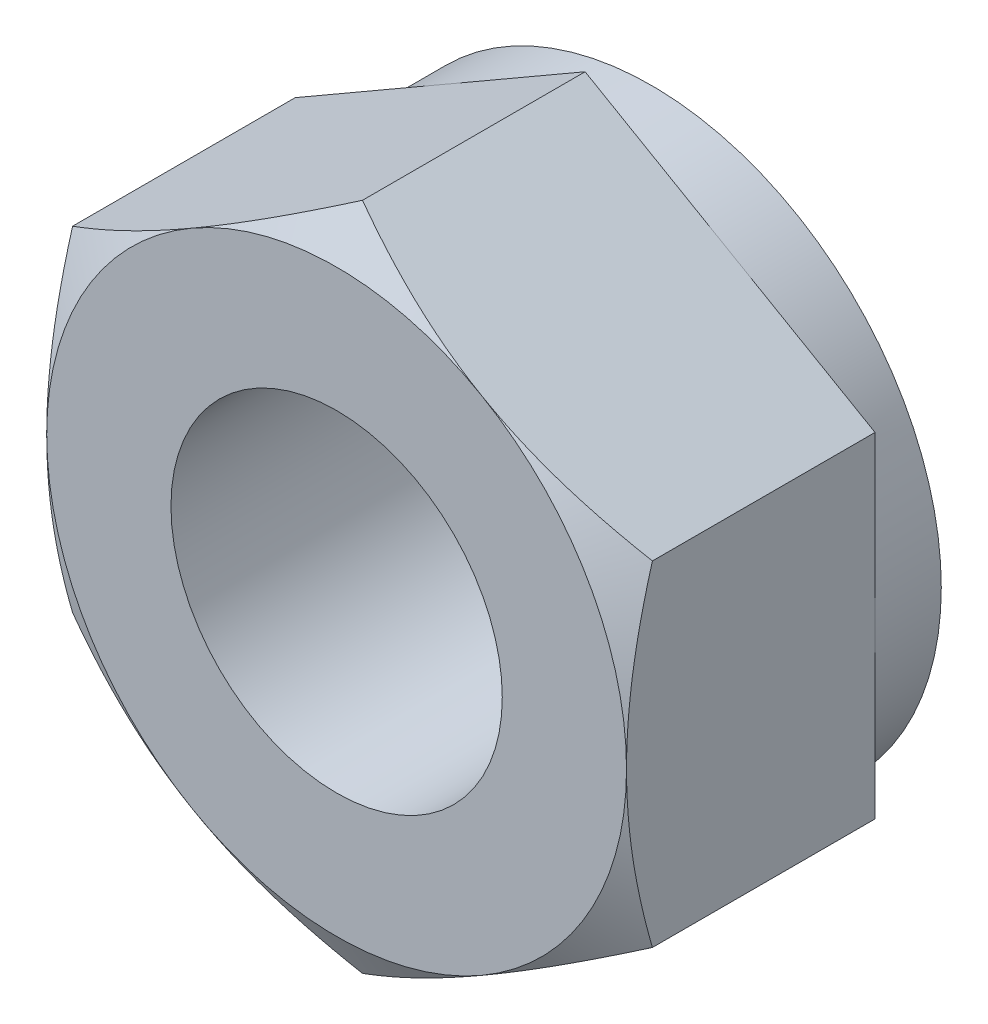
ISO-10303-21;
HEADER;
FILE_DESCRIPTION(('STEP AP214'),'2;1');
FILE_NAME('part.step','',(''),(''),'','','');
FILE_SCHEMA(('AUTOMOTIVE_DESIGN { 1 0 10303 214 1 1 1 1 }'));
ENDSEC;
DATA;
#1=APPLICATION_CONTEXT('core data for automotive mechanical design processes');
#2=APPLICATION_PROTOCOL_DEFINITION('international standard','automotive_design',2000,#1);
#3=PRODUCT_CONTEXT('',#1,'mechanical');
#4=PRODUCT('Part','Part','',(#3));
#5=PRODUCT_RELATED_PRODUCT_CATEGORY('part','',(#4));
#6=PRODUCT_DEFINITION_FORMATION('','',#4);
#7=PRODUCT_DEFINITION_CONTEXT('part definition',#1,'design');
#8=PRODUCT_DEFINITION('design','',#6,#7);
#9=PRODUCT_DEFINITION_SHAPE('','',#8);
#10=(LENGTH_UNIT() NAMED_UNIT(*) SI_UNIT(.MILLI.,.METRE.));
#11=(NAMED_UNIT(*) PLANE_ANGLE_UNIT() SI_UNIT($,.RADIAN.));
#12=(NAMED_UNIT(*) SI_UNIT($,.STERADIAN.) SOLID_ANGLE_UNIT());
#13=UNCERTAINTY_MEASURE_WITH_UNIT(LENGTH_MEASURE(1.E-05),#10,'distance_accuracy_value','');
#14=(GEOMETRIC_REPRESENTATION_CONTEXT(3) GLOBAL_UNCERTAINTY_ASSIGNED_CONTEXT((#13)) GLOBAL_UNIT_ASSIGNED_CONTEXT((#10,
#11,#12)) REPRESENTATION_CONTEXT('',''));
#15=CARTESIAN_POINT('',(0.,0.,0.));
#16=DIRECTION('',(0.,0.,1.));
#17=DIRECTION('',(1.,0.,0.));
#18=AXIS2_PLACEMENT_3D('',#15,#16,#17);
#19=CARTESIAN_POINT('',(0.,-4.,1.6));
#20=DIRECTION('',(0.,0.,-1.));
#21=DIRECTION('',(1.,0.,0.));
#22=AXIS2_PLACEMENT_3D('',#19,#20,#21);
#23=PLANE('',#22);
#24=DIRECTION('',(0.,-1.,0.));
#25=VECTOR('',#24,1.);
#26=CARTESIAN_POINT('',(7.,-4.04145188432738,1.6));
#27=LINE('',#26,#25);
#28=CARTESIAN_POINT('',(7.,4.0414518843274,1.6));
#29=VERTEX_POINT('',#28);
#30=CARTESIAN_POINT('',(7.,0.,1.6));
#31=VERTEX_POINT('',#30);
#32=EDGE_CURVE('E119',#29,#31,#27,.T.);
#33=ORIENTED_EDGE('',*,*,#32,.T.);
#34=CARTESIAN_POINT('',(0.,0.,1.6));
#35=DIRECTION('',(0.,0.,1.));
#36=DIRECTION('',(1.,0.,0.));
#37=AXIS2_PLACEMENT_3D('',#34,#35,#36);
#38=CIRCLE('',#37,7.);
#39=CARTESIAN_POINT('',(3.5,6.06217782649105,1.6));
#40=VERTEX_POINT('',#39);
#41=EDGE_CURVE('E32',#31,#40,#38,.T.);
#42=ORIENTED_EDGE('',*,*,#41,.T.);
#43=DIRECTION('',(0.866025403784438,-0.5,0.));
#44=VECTOR('',#43,1.);
#45=CARTESIAN_POINT('',(7.,4.0414518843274,1.6));
#46=LINE('',#45,#44);
#47=EDGE_CURVE('E117',#40,#29,#46,.T.);
#48=ORIENTED_EDGE('',*,*,#47,.T.);
#49=EDGE_LOOP('',(#33,#42,#48));
#50=FACE_BOUND('',#49,.T.);
#51=ADVANCED_FACE('F14',(#50),#23,.T.);
#52=CARTESIAN_POINT('',(0.,8.08290376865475,1.6));
#53=VERTEX_POINT('',#52);
#54=EDGE_CURVE('E128',#53,#40,#46,.T.);
#55=ORIENTED_EDGE('',*,*,#54,.T.);
#56=CARTESIAN_POINT('',(-3.5,6.0621778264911,1.6));
#57=VERTEX_POINT('',#56);
#58=EDGE_CURVE('E24',#40,#57,#38,.T.);
#59=ORIENTED_EDGE('',*,*,#58,.T.);
#60=DIRECTION('',(0.866025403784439,0.5,0.));
#61=VECTOR('',#60,1.);
#62=CARTESIAN_POINT('',(0.,8.08290376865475,1.6));
#63=LINE('',#62,#61);
#64=EDGE_CURVE('E134',#57,#53,#63,.T.);
#65=ORIENTED_EDGE('',*,*,#64,.T.);
#66=EDGE_LOOP('',(#55,#59,#65));
#67=FACE_BOUND('',#66,.T.);
#68=ADVANCED_FACE('F133',(#67),#23,.T.);
#69=CARTESIAN_POINT('',(-7.,4.0414518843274,1.6));
#70=VERTEX_POINT('',#69);
#71=EDGE_CURVE('E19',#70,#57,#63,.T.);
#72=ORIENTED_EDGE('',*,*,#71,.T.);
#73=CARTESIAN_POINT('',(-7.,0.,1.6));
#74=VERTEX_POINT('',#73);
#75=EDGE_CURVE('E109',#57,#74,#38,.T.);
#76=ORIENTED_EDGE('',*,*,#75,.T.);
#77=DIRECTION('',(0.,1.,0.));
#78=VECTOR('',#77,1.);
#79=CARTESIAN_POINT('',(-7.,4.0414518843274,1.6));
#80=LINE('',#79,#78);
#81=EDGE_CURVE('E154',#74,#70,#80,.T.);
#82=ORIENTED_EDGE('',*,*,#81,.T.);
#83=EDGE_LOOP('',(#72,#76,#82));
#84=FACE_BOUND('',#83,.T.);
#85=ADVANCED_FACE('F253',(#84),#23,.T.);
#86=CARTESIAN_POINT('',(-7.,-4.04145188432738,1.6));
#87=VERTEX_POINT('',#86);
#88=EDGE_CURVE('E155',#87,#74,#80,.T.);
#89=ORIENTED_EDGE('',*,*,#88,.T.);
#90=CARTESIAN_POINT('',(-3.5,-6.06217782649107,1.6));
#91=VERTEX_POINT('',#90);
#92=EDGE_CURVE('E327',#74,#91,#38,.T.);
#93=ORIENTED_EDGE('',*,*,#92,.T.);
#94=DIRECTION('',(-0.866025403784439,0.5,0.));
#95=VECTOR('',#94,1.);
#96=CARTESIAN_POINT('',(-7.,-4.04145188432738,1.6));
#97=LINE('',#96,#95);
#98=EDGE_CURVE('E150',#91,#87,#97,.T.);
#99=ORIENTED_EDGE('',*,*,#98,.T.);
#100=EDGE_LOOP('',(#89,#93,#99));
#101=FACE_BOUND('',#100,.T.);
#102=ADVANCED_FACE('F326',(#101),#23,.T.);
#103=CARTESIAN_POINT('',(0.,-8.08290376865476,1.6));
#104=VERTEX_POINT('',#103);
#105=EDGE_CURVE('E151',#104,#91,#97,.T.);
#106=ORIENTED_EDGE('',*,*,#105,.T.);
#107=CARTESIAN_POINT('',(3.5,-6.06217782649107,1.6));
#108=VERTEX_POINT('',#107);
#109=EDGE_CURVE('E321',#91,#108,#38,.T.);
#110=ORIENTED_EDGE('',*,*,#109,.T.);
#111=DIRECTION('',(-0.866025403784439,-0.5,0.));
#112=VECTOR('',#111,1.);
#113=CARTESIAN_POINT('',(0.,-8.08290376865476,1.6));
#114=LINE('',#113,#112);
#115=EDGE_CURVE('E146',#108,#104,#114,.T.);
#116=ORIENTED_EDGE('',*,*,#115,.T.);
#117=EDGE_LOOP('',(#106,#110,#116));
#118=FACE_BOUND('',#117,.T.);
#119=ADVANCED_FACE('F261',(#118),#23,.T.);
#120=CARTESIAN_POINT('',(7.,-4.04145188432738,1.6));
#121=VERTEX_POINT('',#120);
#122=EDGE_CURVE('E147',#121,#108,#114,.T.);
#123=ORIENTED_EDGE('',*,*,#122,.T.);
#124=EDGE_CURVE('E122',#108,#31,#38,.T.);
#125=ORIENTED_EDGE('',*,*,#124,.T.);
#126=EDGE_CURVE('E136',#31,#121,#27,.T.);
#127=ORIENTED_EDGE('',*,*,#126,.T.);
#128=EDGE_LOOP('',(#123,#125,#127));
#129=FACE_BOUND('',#128,.T.);
#130=ADVANCED_FACE('F255',(#129),#23,.T.);
#131=CARTESIAN_POINT('',(0.,0.,1.6));
#132=DIRECTION('',(0.,0.,1.));
#133=DIRECTION('',(1.,0.,0.));
#134=AXIS2_PLACEMENT_3D('',#131,#132,#133);
#135=CIRCLE('',#134,4.2);
#136=CARTESIAN_POINT('',(4.2,0.,1.6));
#137=VERTEX_POINT('',#136);
#138=EDGE_CURVE('E9',#137,#137,#135,.T.);
#139=ORIENTED_EDGE('',*,*,#138,.F.);
#140=EDGE_LOOP('',(#139));
#141=FACE_BOUND('',#140,.T.);
#142=CARTESIAN_POINT('',(0.,0.,1.6));
#143=DIRECTION('',(0.,0.,-1.));
#144=DIRECTION('',(0.,-1.,0.));
#145=AXIS2_PLACEMENT_3D('',#142,#143,#144);
#146=CIRCLE('',#145,4.);
#147=CARTESIAN_POINT('',(0.,-4.,1.6));
#148=VERTEX_POINT('',#147);
#149=EDGE_CURVE('E121',#148,#148,#146,.T.);
#150=ORIENTED_EDGE('',*,*,#149,.F.);
#151=EDGE_LOOP('',(#150));
#152=FACE_BOUND('',#151,.T.);
#153=ADVANCED_FACE('F189',(#141,#152),#23,.T.);
#154=CARTESIAN_POINT('',(0.,0.,6.97357495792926));
#155=DIRECTION('',(0.,0.,-1.));
#156=DIRECTION('',(1.,0.,0.));
#157=AXIS2_PLACEMENT_3D('',#154,#155,#156);
#158=CONICAL_SURFACE('',#157,8.085,1.0471975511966);
#159=CARTESIAN_POINT('',(1.99999999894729E-06,8.0829049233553,6.97478455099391));
#160=CARTESIAN_POINT('',(-0.153864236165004,7.99407021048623,7.02606342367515));
#161=CARTESIAN_POINT('',(-0.308304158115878,7.90490427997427,7.07501487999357));
#162=CARTESIAN_POINT('',(-0.618438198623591,7.72584830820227,7.16762197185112));
#163=CARTESIAN_POINT('',(-0.77413282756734,7.63595797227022,7.2112753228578));
#164=CARTESIAN_POINT('',(-1.24370940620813,7.36484780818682,7.33343129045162));
#165=CARTESIAN_POINT('',(-1.55944487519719,7.18255785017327,7.40291113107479));
#166=CARTESIAN_POINT('',(-2.03193722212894,6.90976426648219,7.48438250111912));
#167=CARTESIAN_POINT('',(-2.187282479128,6.82007564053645,7.5075909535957));
#168=CARTESIAN_POINT('',(-2.49867481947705,6.64029318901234,7.54650721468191));
#169=CARTESIAN_POINT('',(-2.65472183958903,6.55019939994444,7.56221568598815));
#170=CARTESIAN_POINT('',(-2.96708681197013,6.36985539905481,7.58573165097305));
#171=CARTESIAN_POINT('',(-3.12340425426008,6.27960548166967,7.5935481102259));
#172=CARTESIAN_POINT('',(-3.4361747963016,6.09902732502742,7.60112083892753));
#173=CARTESIAN_POINT('',(-3.59262789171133,6.00869908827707,7.60087735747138));
#174=CARTESIAN_POINT('',(-4.02123175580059,5.76124453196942,7.58913225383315));
#175=CARTESIAN_POINT('',(-4.29324214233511,5.60419926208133,7.56942514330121));
#176=CARTESIAN_POINT('',(-4.83545629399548,5.29115177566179,7.50694040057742));
#177=CARTESIAN_POINT('',(-5.10565815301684,5.13515065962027,7.46414142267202));
#178=CARTESIAN_POINT('',(-5.64896301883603,4.82147344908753,7.35715902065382));
#179=CARTESIAN_POINT('',(-5.92199748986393,4.66383692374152,7.29252243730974));
#180=CARTESIAN_POINT('',(-6.46399530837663,4.35091433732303,7.14582447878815));
#181=CARTESIAN_POINT('',(-6.73296559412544,4.19562427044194,7.06379755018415));
#182=CARTESIAN_POINT('',(-7.000002,4.04145072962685,6.97478455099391));
#183=B_SPLINE_CURVE_WITH_KNOTS('',3,(#159,#160,#161,#162,#163,#164,#165,#166,#167,#168,#169,
#170,#171,#172,#173,#174,#175,#176,#177,#178,#179,#180,#181,#182),.UNSPECIFIED.,.F.,.F.,(4,2,2,
2,2,2,2,2,2,2,2,4),(0.,0.554720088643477,1.10967852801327,2.22190100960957,2.76439159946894,
3.30683424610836,3.8486599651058,4.39046893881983,5.33360408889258,6.27761255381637,
7.24255463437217,8.20560293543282),.UNSPECIFIED.);
#184=CARTESIAN_POINT('',(-3.5,6.0621778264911,7.6));
#185=VERTEX_POINT('',#184);
#186=CARTESIAN_POINT('',(-7.,4.0414518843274,6.97478521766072));
#187=VERTEX_POINT('',#186);
#188=EDGE_CURVE('E172',#185,#187,#183,.T.);
#189=ORIENTED_EDGE('',*,*,#188,.T.);
#190=CARTESIAN_POINT('',(-7.,10.7186938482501,4.2502319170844));
#191=CARTESIAN_POINT('',(-7.,10.4113529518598,4.39875670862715));
#192=CARTESIAN_POINT('',(-7.,10.103285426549,4.54580509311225));
#193=CARTESIAN_POINT('',(-7.,9.48530421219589,4.83610537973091));
#194=CARTESIAN_POINT('',(-7.,9.17539021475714,4.9793566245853));
#195=CARTESIAN_POINT('',(-7.,8.55164910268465,5.2619735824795));
#196=CARTESIAN_POINT('',(-7.,8.23780974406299,5.40131237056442));
#197=CARTESIAN_POINT('',(-7.,7.60755166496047,5.67400525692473));
#198=CARTESIAN_POINT('',(-7.,7.29113307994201,5.80735966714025));
#199=CARTESIAN_POINT('',(-7.,6.65128414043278,6.0680759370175));
#200=CARTESIAN_POINT('',(-7.,6.32781539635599,6.19534410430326));
#201=CARTESIAN_POINT('',(-7.,5.67706348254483,6.43991333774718));
#202=CARTESIAN_POINT('',(-7.,5.34977989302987,6.55721329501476));
#203=CARTESIAN_POINT('',(-7.,4.69154570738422,6.77869395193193));
#204=CARTESIAN_POINT('',(-7.,4.36060459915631,6.88290254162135));
#205=CARTESIAN_POINT('',(-7.,3.69402950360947,7.07481793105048));
#206=CARTESIAN_POINT('',(-7.,3.3583970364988,7.16252994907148));
#207=CARTESIAN_POINT('',(-7.,2.68215396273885,7.31718772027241));
#208=CARTESIAN_POINT('',(-7.,2.34154205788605,7.38412795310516));
#209=CARTESIAN_POINT('',(-7.,1.82762680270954,7.46560780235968));
#210=CARTESIAN_POINT('',(-7.,1.6558010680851,7.48961443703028));
#211=CARTESIAN_POINT('',(-7.,1.31134394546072,7.53084519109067));
#212=CARTESIAN_POINT('',(-7.,1.13871263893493,7.54806998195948));
#213=CARTESIAN_POINT('',(-7.,0.793972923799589,7.57527349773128));
#214=CARTESIAN_POINT('',(-7.,0.621868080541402,7.58529722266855));
#215=CARTESIAN_POINT('',(-7.,0.277388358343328,7.59804560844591));
#216=CARTESIAN_POINT('',(-7.,0.105013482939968,7.6007703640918));
#217=CARTESIAN_POINT('',(-7.,-0.239647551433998,7.59885588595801));
#218=CARTESIAN_POINT('',(-7.,-0.411933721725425,7.59421871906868));
#219=CARTESIAN_POINT('',(-7.,-0.756160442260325,7.57769571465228));
#220=CARTESIAN_POINT('',(-7.,-0.928100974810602,7.56580951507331));
#221=CARTESIAN_POINT('',(-7.,-1.344826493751,7.5284645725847));
#222=CARTESIAN_POINT('',(-7.,-1.58929135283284,7.49937410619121));
#223=CARTESIAN_POINT('',(-7.00000000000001,-2.0763478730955,7.42815392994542));
#224=CARTESIAN_POINT('',(-7.,-2.31893900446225,7.38602066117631));
#225=CARTESIAN_POINT('',(-7.,-2.80204789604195,7.29020921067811));
#226=CARTESIAN_POINT('',(-7.00000000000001,-3.04256347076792,7.23652011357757));
#227=CARTESIAN_POINT('',(-7.00000000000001,-3.5211201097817,7.11923513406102));
#228=CARTESIAN_POINT('',(-7.00000000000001,-3.75916140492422,7.05564018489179));
#229=CARTESIAN_POINT('',(-7.00000000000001,-4.23863262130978,6.91840251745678));
#230=CARTESIAN_POINT('',(-7.00000000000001,-4.48000256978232,6.84455170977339));
#231=CARTESIAN_POINT('',(-7.00000000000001,-4.9601911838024,6.6895528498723));
#232=CARTESIAN_POINT('',(-7.00000000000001,-5.19901148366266,6.60840983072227));
#233=CARTESIAN_POINT('',(-7.00000000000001,-5.67314250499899,6.44050266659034));
#234=CARTESIAN_POINT('',(-7.00000000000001,-5.90846541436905,6.35377273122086));
#235=CARTESIAN_POINT('',(-7.00000000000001,-6.37728542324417,6.17522207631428));
#236=CARTESIAN_POINT('',(-7.,-6.6107817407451,6.0833992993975));
#237=CARTESIAN_POINT('',(-7.,-6.84342977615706,5.98953388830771));
#238=B_SPLINE_CURVE_WITH_KNOTS('',3,(#190,#191,#192,#193,#194,#195,#196,#197,#198,#199,#200,
#201,#202,#203,#204,#205,#206,#207,#208,#209,#210,#211,#212,#213,#214,#215,#216,#217,#218,#219,
#220,#221,#222,#223,#224,#225,#226,#227,#228,#229,#230,#231,#232,#233,#234,#235,#236,#237),
.UNSPECIFIED.,.F.,.F.,(4,2,2,2,2,2,2,2,2,2,2,2,2,2,2,2,2,2,2,2,2,2,2,4),(0.,1.02405590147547,
2.04828792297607,3.07838091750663,4.10842015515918,5.15110763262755,6.19391095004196,
7.23445356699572,8.27466647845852,9.31515560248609,9.83552677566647,10.3558464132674,
10.8728855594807,11.3899179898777,11.9068052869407,12.4237184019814,13.1618758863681,
13.9002349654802,14.6392945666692,15.3782845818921,16.1353896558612,16.8919761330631,
17.6443041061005,18.39693824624),.UNSPECIFIED.);
#239=CARTESIAN_POINT('',(-7.,0.,7.6));
#240=VERTEX_POINT('',#239);
#241=EDGE_CURVE('E131',#187,#240,#238,.T.);
#242=ORIENTED_EDGE('',*,*,#241,.T.);
#243=CARTESIAN_POINT('',(0.,0.,7.6));
#244=DIRECTION('',(0.,0.,-1.));
#245=DIRECTION('',(1.,0.,0.));
#246=AXIS2_PLACEMENT_3D('',#243,#244,#245);
#247=CIRCLE('',#246,7.);
#248=EDGE_CURVE('E296',#240,#185,#247,.T.);
#249=ORIENTED_EDGE('',*,*,#248,.T.);
#250=EDGE_LOOP('',(#189,#242,#249));
#251=FACE_BOUND('',#250,.T.);
#252=ADVANCED_FACE('F184',(#251),#158,.T.);
#253=CARTESIAN_POINT('',(-3.5,-6.06217782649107,7.6));
#254=VERTEX_POINT('',#253);
#255=EDGE_CURVE('E288',#254,#240,#247,.T.);
#256=ORIENTED_EDGE('',*,*,#255,.T.);
#257=CARTESIAN_POINT('',(-7.,-4.04145188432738,6.97478521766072));
#258=VERTEX_POINT('',#257);
#259=EDGE_CURVE('E40',#240,#258,#238,.T.);
#260=ORIENTED_EDGE('',*,*,#259,.T.);
#261=CARTESIAN_POINT('',(-7.000002,-4.04145072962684,6.97478455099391));
#262=CARTESIAN_POINT('',(-6.84613576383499,-4.1302854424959,7.02606342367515));
#263=CARTESIAN_POINT('',(-6.69169584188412,-4.21945137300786,7.07501487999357));
#264=CARTESIAN_POINT('',(-6.3815618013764,-4.39850734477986,7.16762197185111));
#265=CARTESIAN_POINT('',(-6.22586717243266,-4.48839768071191,7.21127532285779));
#266=CARTESIAN_POINT('',(-5.75629059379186,-4.75950784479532,7.33343129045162));
#267=CARTESIAN_POINT('',(-5.44055512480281,-4.94179780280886,7.40291113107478));
#268=CARTESIAN_POINT('',(-4.96806277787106,-5.21459138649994,7.48438250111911));
#269=CARTESIAN_POINT('',(-4.812717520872,-5.30428001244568,7.5075909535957));
#270=CARTESIAN_POINT('',(-4.50132518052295,-5.48406246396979,7.5465072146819));
#271=CARTESIAN_POINT('',(-4.34527816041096,-5.57415625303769,7.56221568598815));
#272=CARTESIAN_POINT('',(-4.03291318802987,-5.75450025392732,7.58573165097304));
#273=CARTESIAN_POINT('',(-3.87659574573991,-5.84475017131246,7.59354811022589));
#274=CARTESIAN_POINT('',(-3.5638252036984,-6.02532832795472,7.60112083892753));
#275=CARTESIAN_POINT('',(-3.40737210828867,-6.11565656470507,7.60087735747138));
#276=CARTESIAN_POINT('',(-2.97876824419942,-6.36311112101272,7.58913225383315));
#277=CARTESIAN_POINT('',(-2.70675785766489,-6.5201563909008,7.5694251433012));
#278=CARTESIAN_POINT('',(-2.16454370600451,-6.83320387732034,7.50694040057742));
#279=CARTESIAN_POINT('',(-1.89434184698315,-6.98920499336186,7.46414142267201));
#280=CARTESIAN_POINT('',(-1.35103698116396,-7.3028822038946,7.35715902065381));
#281=CARTESIAN_POINT('',(-1.07800251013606,-7.46051872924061,7.29252243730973));
#282=CARTESIAN_POINT('',(-0.536004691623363,-7.77344131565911,7.14582447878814));
#283=CARTESIAN_POINT('',(-0.267034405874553,-7.92873138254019,7.06379755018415));
#284=CARTESIAN_POINT('',(1.99999999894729E-06,-8.0829049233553,6.97478455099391));
#285=B_SPLINE_CURVE_WITH_KNOTS('',3,(#261,#262,#263,#264,#265,#266,#267,#268,#269,#270,#271,
#272,#273,#274,#275,#276,#277,#278,#279,#280,#281,#282,#283,#284),.UNSPECIFIED.,.F.,.F.,(4,2,2,
2,2,2,2,2,2,2,2,4),(0.,0.554720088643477,1.10967852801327,2.22190100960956,2.76439159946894,
3.30683424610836,3.8486599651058,4.39046893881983,5.33360408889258,6.27761255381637,
7.24255463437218,8.20560293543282),.UNSPECIFIED.);
#286=EDGE_CURVE('E226',#258,#254,#285,.T.);
#287=ORIENTED_EDGE('',*,*,#286,.T.);
#288=EDGE_LOOP('',(#256,#260,#287));
#289=FACE_BOUND('',#288,.T.);
#290=ADVANCED_FACE('F188',(#289),#158,.T.);
#291=CARTESIAN_POINT('',(3.5,-6.06217782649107,7.6));
#292=VERTEX_POINT('',#291);
#293=EDGE_CURVE('E280',#292,#254,#247,.T.);
#294=ORIENTED_EDGE('',*,*,#293,.T.);
#295=CARTESIAN_POINT('',(0.,-8.08290376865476,6.97478521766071));
#296=VERTEX_POINT('',#295);
#297=EDGE_CURVE('E220',#254,#296,#285,.T.);
#298=ORIENTED_EDGE('',*,*,#297,.T.);
#299=CARTESIAN_POINT('',(-2.00000000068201E-06,-8.0829049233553,6.97478455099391));
#300=CARTESIAN_POINT('',(0.153864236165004,-7.99407021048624,7.02606342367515));
#301=CARTESIAN_POINT('',(0.30830415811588,-7.90490427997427,7.07501487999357));
#302=CARTESIAN_POINT('',(0.618438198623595,-7.72584830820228,7.16762197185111));
#303=CARTESIAN_POINT('',(0.774132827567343,-7.63595797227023,7.21127532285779));
#304=CARTESIAN_POINT('',(1.24370940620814,-7.36484780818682,7.33343129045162));
#305=CARTESIAN_POINT('',(1.55944487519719,-7.18255785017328,7.40291113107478));
#306=CARTESIAN_POINT('',(2.03193722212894,-6.9097642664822,7.48438250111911));
#307=CARTESIAN_POINT('',(2.187282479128,-6.82007564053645,7.5075909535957));
#308=CARTESIAN_POINT('',(2.49867481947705,-6.64029318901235,7.5465072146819));
#309=CARTESIAN_POINT('',(2.65472183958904,-6.55019939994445,7.56221568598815));
#310=CARTESIAN_POINT('',(2.96708681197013,-6.36985539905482,7.58573165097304));
#311=CARTESIAN_POINT('',(3.12340425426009,-6.27960548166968,7.59354811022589));
#312=CARTESIAN_POINT('',(3.4361747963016,-6.09902732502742,7.60112083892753));
#313=CARTESIAN_POINT('',(3.59262789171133,-6.00869908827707,7.60087735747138));
#314=CARTESIAN_POINT('',(4.02123175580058,-5.76124453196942,7.58913225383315));
#315=CARTESIAN_POINT('',(4.29324214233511,-5.60419926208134,7.5694251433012));
#316=CARTESIAN_POINT('',(4.83545629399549,-5.2911517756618,7.50694040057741));
#317=CARTESIAN_POINT('',(5.10565815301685,-5.13515065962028,7.46414142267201));
#318=CARTESIAN_POINT('',(5.64896301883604,-4.82147344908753,7.35715902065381));
#319=CARTESIAN_POINT('',(5.92199748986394,-4.66383692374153,7.29252243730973));
#320=CARTESIAN_POINT('',(6.46399530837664,-4.35091433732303,7.14582447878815));
#321=CARTESIAN_POINT('',(6.73296559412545,-4.19562427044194,7.06379755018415));
#322=CARTESIAN_POINT('',(7.000002,-4.04145072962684,6.97478455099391));
#323=B_SPLINE_CURVE_WITH_KNOTS('',3,(#299,#300,#301,#302,#303,#304,#305,#306,#307,#308,#309,
#310,#311,#312,#313,#314,#315,#316,#317,#318,#319,#320,#321,#322),.UNSPECIFIED.,.F.,.F.,(4,2,2,
2,2,2,2,2,2,2,2,4),(0.,0.554720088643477,1.10967852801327,2.22190100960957,2.76439159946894,
3.30683424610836,3.8486599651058,4.39046893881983,5.33360408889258,6.27761255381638,
7.24255463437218,8.20560293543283),.UNSPECIFIED.);
#324=EDGE_CURVE('E227',#296,#292,#323,.T.);
#325=ORIENTED_EDGE('',*,*,#324,.T.);
#326=EDGE_LOOP('',(#294,#298,#325));
#327=FACE_BOUND('',#326,.T.);
#328=ADVANCED_FACE('F310',(#327),#158,.T.);
#329=CARTESIAN_POINT('',(7.,0.,7.6));
#330=VERTEX_POINT('',#329);
#331=EDGE_CURVE('E278',#330,#292,#247,.T.);
#332=ORIENTED_EDGE('',*,*,#331,.T.);
#333=CARTESIAN_POINT('',(7.,-4.04145188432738,6.97478521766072));
#334=VERTEX_POINT('',#333);
#335=EDGE_CURVE('E214',#292,#334,#323,.T.);
#336=ORIENTED_EDGE('',*,*,#335,.T.);
#337=CARTESIAN_POINT('',(7.,10.71869384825,4.25023191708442));
#338=CARTESIAN_POINT('',(7.00000000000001,10.4113529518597,4.39875670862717));
#339=CARTESIAN_POINT('',(7.00000000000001,10.103285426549,4.54580509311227));
#340=CARTESIAN_POINT('',(7.00000000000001,9.48530421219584,4.83610537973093));
#341=CARTESIAN_POINT('',(7.00000000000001,9.17539021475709,4.97935662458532));
#342=CARTESIAN_POINT('',(7.00000000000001,8.5516491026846,5.26197358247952));
#343=CARTESIAN_POINT('',(7.00000000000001,8.23780974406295,5.40131237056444));
#344=CARTESIAN_POINT('',(7.00000000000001,7.60755166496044,5.67400525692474));
#345=CARTESIAN_POINT('',(7.00000000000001,7.29113307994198,5.80735966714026));
#346=CARTESIAN_POINT('',(7.00000000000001,6.65128414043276,6.06807593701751));
#347=CARTESIAN_POINT('',(7.00000000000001,6.32781539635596,6.19534410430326));
#348=CARTESIAN_POINT('',(7.00000000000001,5.67706348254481,6.43991333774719));
#349=CARTESIAN_POINT('',(7.00000000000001,5.34977989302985,6.55721329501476));
#350=CARTESIAN_POINT('',(7.00000000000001,4.6915457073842,6.77869395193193));
#351=CARTESIAN_POINT('',(7.00000000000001,4.3606045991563,6.88290254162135));
#352=CARTESIAN_POINT('',(7.,3.69402950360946,7.07481793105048));
#353=CARTESIAN_POINT('',(7.,3.3583970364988,7.16252994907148));
#354=CARTESIAN_POINT('',(7.,2.68215396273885,7.31718772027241));
#355=CARTESIAN_POINT('',(7.,2.34154205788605,7.38412795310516));
#356=CARTESIAN_POINT('',(7.,1.82762680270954,7.46560780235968));
#357=CARTESIAN_POINT('',(7.,1.6558010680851,7.48961443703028));
#358=CARTESIAN_POINT('',(7.,1.31134394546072,7.53084519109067));
#359=CARTESIAN_POINT('',(7.,1.13871263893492,7.54806998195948));
#360=CARTESIAN_POINT('',(7.,0.793972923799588,7.57527349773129));
#361=CARTESIAN_POINT('',(7.,0.6218680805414,7.58529722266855));
#362=CARTESIAN_POINT('',(7.,0.277388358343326,7.59804560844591));
#363=CARTESIAN_POINT('',(7.,0.105013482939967,7.6007703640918));
#364=CARTESIAN_POINT('',(7.,-0.239647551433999,7.59885588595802));
#365=CARTESIAN_POINT('',(7.,-0.411933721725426,7.59421871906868));
#366=CARTESIAN_POINT('',(7.,-0.756160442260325,7.57769571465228));
#367=CARTESIAN_POINT('',(7.,-0.928100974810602,7.56580951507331));
#368=CARTESIAN_POINT('',(7.,-1.344826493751,7.5284645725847));
#369=CARTESIAN_POINT('',(7.,-1.58929135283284,7.49937410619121));
#370=CARTESIAN_POINT('',(7.,-2.07634787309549,7.42815392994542));
#371=CARTESIAN_POINT('',(7.,-2.31893900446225,7.38602066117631));
#372=CARTESIAN_POINT('',(7.,-2.80204789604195,7.29020921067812));
#373=CARTESIAN_POINT('',(7.,-3.04256347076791,7.23652011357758));
#374=CARTESIAN_POINT('',(7.,-3.5211201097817,7.11923513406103));
#375=CARTESIAN_POINT('',(7.,-3.75916140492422,7.05564018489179));
#376=CARTESIAN_POINT('',(7.,-4.23863262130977,6.91840251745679));
#377=CARTESIAN_POINT('',(7.,-4.48000256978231,6.84455170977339));
#378=CARTESIAN_POINT('',(7.,-4.96019118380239,6.6895528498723));
#379=CARTESIAN_POINT('',(7.,-5.19901148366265,6.60840983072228));
#380=CARTESIAN_POINT('',(7.,-5.67314250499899,6.44050266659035));
#381=CARTESIAN_POINT('',(7.,-5.90846541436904,6.35377273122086));
#382=CARTESIAN_POINT('',(7.,-6.37728542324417,6.17522207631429));
#383=CARTESIAN_POINT('',(7.,-6.61078174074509,6.0833992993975));
#384=CARTESIAN_POINT('',(7.,-6.84342977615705,5.98953388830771));
#385=B_SPLINE_CURVE_WITH_KNOTS('',3,(#337,#338,#339,#340,#341,#342,#343,#344,#345,#346,#347,
#348,#349,#350,#351,#352,#353,#354,#355,#356,#357,#358,#359,#360,#361,#362,#363,#364,#365,#366,
#367,#368,#369,#370,#371,#372,#373,#374,#375,#376,#377,#378,#379,#380,#381,#382,#383,#384),
.UNSPECIFIED.,.F.,.F.,(4,2,2,2,2,2,2,2,2,2,2,2,2,2,2,2,2,2,2,2,2,2,2,4),(0.,1.02405590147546,
2.04828792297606,3.07838091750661,4.10842015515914,5.15110763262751,6.19391095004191,
7.23445356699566,8.27466647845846,9.31515560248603,9.83552677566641,10.3558464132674,
10.8728855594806,11.3899179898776,11.9068052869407,12.4237184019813,13.161875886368,
13.9002349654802,14.6392945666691,15.378284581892,16.1353896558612,16.8919761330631,
17.6443041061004,18.3969382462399),.UNSPECIFIED.);
#386=EDGE_CURVE('E312',#334,#330,#385,.F.);
#387=ORIENTED_EDGE('',*,*,#386,.T.);
#388=EDGE_LOOP('',(#332,#336,#387));
#389=FACE_BOUND('',#388,.T.);
#390=ADVANCED_FACE('F339',(#389),#158,.T.);
#391=CARTESIAN_POINT('',(3.5,6.06217782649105,7.6));
#392=VERTEX_POINT('',#391);
#393=EDGE_CURVE('E277',#392,#330,#247,.T.);
#394=ORIENTED_EDGE('',*,*,#393,.T.);
#395=CARTESIAN_POINT('',(7.,4.0414518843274,6.97478521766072));
#396=VERTEX_POINT('',#395);
#397=EDGE_CURVE('E207',#330,#396,#385,.F.);
#398=ORIENTED_EDGE('',*,*,#397,.T.);
#399=CARTESIAN_POINT('',(7.000002,4.04145072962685,6.97478455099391));
#400=CARTESIAN_POINT('',(6.846135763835,4.13028544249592,7.02606342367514));
#401=CARTESIAN_POINT('',(6.69169584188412,4.21945137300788,7.07501487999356));
#402=CARTESIAN_POINT('',(6.38156180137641,4.39850734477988,7.16762197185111));
#403=CARTESIAN_POINT('',(6.22586717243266,4.48839768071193,7.21127532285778));
#404=CARTESIAN_POINT('',(5.75629059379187,4.75950784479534,7.33343129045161));
#405=CARTESIAN_POINT('',(5.44055512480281,4.94179780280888,7.40291113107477));
#406=CARTESIAN_POINT('',(4.96806277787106,5.21459138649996,7.4843825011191));
#407=CARTESIAN_POINT('',(4.812717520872,5.3042800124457,7.50759095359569));
#408=CARTESIAN_POINT('',(4.50132518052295,5.48406246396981,7.54650721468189));
#409=CARTESIAN_POINT('',(4.34527816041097,5.57415625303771,7.56221568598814));
#410=CARTESIAN_POINT('',(4.03291318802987,5.75450025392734,7.58573165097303));
#411=CARTESIAN_POINT('',(3.87659574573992,5.84475017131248,7.59354811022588));
#412=CARTESIAN_POINT('',(3.5638252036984,6.02532832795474,7.60112083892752));
#413=CARTESIAN_POINT('',(3.40737210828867,6.11565656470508,7.60087735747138));
#414=CARTESIAN_POINT('',(2.97876824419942,6.36311112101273,7.58913225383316));
#415=CARTESIAN_POINT('',(2.70675785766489,6.52015639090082,7.5694251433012));
#416=CARTESIAN_POINT('',(2.16454370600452,6.83320387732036,7.5069404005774));
#417=CARTESIAN_POINT('',(1.89434184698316,6.98920499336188,7.464141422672));
#418=CARTESIAN_POINT('',(1.35103698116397,7.30288220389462,7.3571590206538));
#419=CARTESIAN_POINT('',(1.07800251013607,7.46051872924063,7.29252243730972));
#420=CARTESIAN_POINT('',(0.536004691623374,7.77344131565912,7.14582447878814));
#421=CARTESIAN_POINT('',(0.26703440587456,7.92873138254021,7.06379755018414));
#422=CARTESIAN_POINT('',(-2.00000000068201E-06,8.0829049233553,6.97478455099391));
#423=B_SPLINE_CURVE_WITH_KNOTS('',3,(#399,#400,#401,#402,#403,#404,#405,#406,#407,#408,#409,
#410,#411,#412,#413,#414,#415,#416,#417,#418,#419,#420,#421,#422),.UNSPECIFIED.,.F.,.F.,(4,2,2,
2,2,2,2,2,2,2,2,4),(0.,0.554720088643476,1.10967852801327,2.22190100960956,2.76439159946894,
3.30683424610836,3.84865996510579,4.39046893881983,5.33360408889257,6.27761255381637,
7.24255463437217,8.20560293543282),.UNSPECIFIED.);
#424=EDGE_CURVE('E286',#396,#392,#423,.T.);
#425=ORIENTED_EDGE('',*,*,#424,.T.);
#426=EDGE_LOOP('',(#394,#398,#425));
#427=FACE_BOUND('',#426,.T.);
#428=ADVANCED_FACE('F313',(#427),#158,.T.);
#429=EDGE_CURVE('E290',#185,#392,#247,.T.);
#430=ORIENTED_EDGE('',*,*,#429,.T.);
#431=CARTESIAN_POINT('',(0.,8.08290376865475,6.97478521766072));
#432=VERTEX_POINT('',#431);
#433=EDGE_CURVE('E199',#392,#432,#423,.T.);
#434=ORIENTED_EDGE('',*,*,#433,.T.);
#435=EDGE_CURVE('E179',#432,#185,#183,.T.);
#436=ORIENTED_EDGE('',*,*,#435,.T.);
#437=EDGE_LOOP('',(#430,#434,#436));
#438=FACE_BOUND('',#437,.T.);
#439=ADVANCED_FACE('F191',(#438),#158,.T.);
#440=CARTESIAN_POINT('',(0.,-7.,7.6));
#441=DIRECTION('',(0.,0.,1.));
#442=DIRECTION('',(-1.,0.,0.));
#443=AXIS2_PLACEMENT_3D('',#440,#441,#442);
#444=PLANE('',#443);
#445=CARTESIAN_POINT('',(0.,0.,7.6));
#446=DIRECTION('',(0.,0.,1.));
#447=DIRECTION('',(0.,1.,0.));
#448=AXIS2_PLACEMENT_3D('',#445,#446,#447);
#449=CIRCLE('',#448,4.);
#450=CARTESIAN_POINT('',(0.,4.,7.6));
#451=VERTEX_POINT('',#450);
#452=EDGE_CURVE('E268',#451,#451,#449,.T.);
#453=ORIENTED_EDGE('',*,*,#452,.F.);
#454=EDGE_LOOP('',(#453));
#455=FACE_BOUND('',#454,.T.);
#456=ORIENTED_EDGE('',*,*,#331,.F.);
#457=ORIENTED_EDGE('',*,*,#393,.F.);
#458=ORIENTED_EDGE('',*,*,#429,.F.);
#459=ORIENTED_EDGE('',*,*,#248,.F.);
#460=ORIENTED_EDGE('',*,*,#255,.F.);
#461=ORIENTED_EDGE('',*,*,#293,.F.);
#462=EDGE_LOOP('',(#456,#457,#458,#459,#460,#461));
#463=FACE_BOUND('',#462,.T.);
#464=ADVANCED_FACE('F192',(#455,#463),#444,.T.);
#465=CARTESIAN_POINT('',(-7.,4.0414518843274,8.6));
#466=DIRECTION('',(1.,0.,0.));
#467=DIRECTION('',(0.,1.,0.));
#468=AXIS2_PLACEMENT_3D('',#465,#466,#467);
#469=PLANE('',#468);
#470=ORIENTED_EDGE('',*,*,#88,.F.);
#471=DIRECTION('',(0.,0.,-1.));
#472=VECTOR('',#471,1.);
#473=CARTESIAN_POINT('',(-7.,-4.04145188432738,8.6));
#474=LINE('',#473,#472);
#475=EDGE_CURVE('E170',#258,#87,#474,.T.);
#476=ORIENTED_EDGE('',*,*,#475,.F.);
#477=ORIENTED_EDGE('',*,*,#259,.F.);
#478=ORIENTED_EDGE('',*,*,#241,.F.);
#479=DIRECTION('',(0.,0.,-1.));
#480=VECTOR('',#479,1.);
#481=CARTESIAN_POINT('',(-7.,4.0414518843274,8.6));
#482=LINE('',#481,#480);
#483=EDGE_CURVE('E158',#187,#70,#482,.T.);
#484=ORIENTED_EDGE('',*,*,#483,.T.);
#485=ORIENTED_EDGE('',*,*,#81,.F.);
#486=EDGE_LOOP('',(#470,#476,#477,#478,#484,#485));
#487=FACE_BOUND('',#486,.T.);
#488=ADVANCED_FACE('F16',(#487),#469,.F.);
#489=CARTESIAN_POINT('',(-7.,-4.04145188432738,8.6));
#490=DIRECTION('',(0.5,0.866025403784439,0.));
#491=DIRECTION('',(-0.866025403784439,0.5,0.));
#492=AXIS2_PLACEMENT_3D('',#489,#490,#491);
#493=PLANE('',#492);
#494=ORIENTED_EDGE('',*,*,#105,.F.);
#495=DIRECTION('',(0.,0.,-1.));
#496=VECTOR('',#495,1.);
#497=CARTESIAN_POINT('',(0.,-8.08290376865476,8.6));
#498=LINE('',#497,#496);
#499=EDGE_CURVE('E167',#296,#104,#498,.T.);
#500=ORIENTED_EDGE('',*,*,#499,.F.);
#501=ORIENTED_EDGE('',*,*,#297,.F.);
#502=ORIENTED_EDGE('',*,*,#286,.F.);
#503=ORIENTED_EDGE('',*,*,#475,.T.);
#504=ORIENTED_EDGE('',*,*,#98,.F.);
#505=EDGE_LOOP('',(#494,#500,#501,#502,#503,#504));
#506=FACE_BOUND('',#505,.T.);
#507=ADVANCED_FACE('F228',(#506),#493,.F.);
#508=CARTESIAN_POINT('',(0.,-8.08290376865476,8.6));
#509=DIRECTION('',(-0.5,0.866025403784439,0.));
#510=DIRECTION('',(-0.866025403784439,-0.5,0.));
#511=AXIS2_PLACEMENT_3D('',#508,#509,#510);
#512=PLANE('',#511);
#513=ORIENTED_EDGE('',*,*,#122,.F.);
#514=DIRECTION('',(0.,0.,-1.));
#515=VECTOR('',#514,1.);
#516=CARTESIAN_POINT('',(7.,-4.04145188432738,8.6));
#517=LINE('',#516,#515);
#518=EDGE_CURVE('E164',#334,#121,#517,.T.);
#519=ORIENTED_EDGE('',*,*,#518,.F.);
#520=ORIENTED_EDGE('',*,*,#335,.F.);
#521=ORIENTED_EDGE('',*,*,#324,.F.);
#522=ORIENTED_EDGE('',*,*,#499,.T.);
#523=ORIENTED_EDGE('',*,*,#115,.F.);
#524=EDGE_LOOP('',(#513,#519,#520,#521,#522,#523));
#525=FACE_BOUND('',#524,.T.);
#526=ADVANCED_FACE('F231',(#525),#512,.F.);
#527=CARTESIAN_POINT('',(7.,-4.04145188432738,8.6));
#528=DIRECTION('',(-1.,0.,0.));
#529=DIRECTION('',(0.,-1.,0.));
#530=AXIS2_PLACEMENT_3D('',#527,#528,#529);
#531=PLANE('',#530);
#532=ORIENTED_EDGE('',*,*,#32,.F.);
#533=DIRECTION('',(0.,0.,-1.));
#534=VECTOR('',#533,1.);
#535=CARTESIAN_POINT('',(7.,4.0414518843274,8.6));
#536=LINE('',#535,#534);
#537=EDGE_CURVE('E130',#396,#29,#536,.T.);
#538=ORIENTED_EDGE('',*,*,#537,.F.);
#539=ORIENTED_EDGE('',*,*,#397,.F.);
#540=ORIENTED_EDGE('',*,*,#386,.F.);
#541=ORIENTED_EDGE('',*,*,#518,.T.);
#542=ORIENTED_EDGE('',*,*,#126,.F.);
#543=EDGE_LOOP('',(#532,#538,#539,#540,#541,#542));
#544=FACE_BOUND('',#543,.T.);
#545=ADVANCED_FACE('F235',(#544),#531,.F.);
#546=CARTESIAN_POINT('',(7.,4.0414518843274,8.6));
#547=DIRECTION('',(-0.5,-0.866025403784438,0.));
#548=DIRECTION('',(0.866025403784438,-0.5,0.));
#549=AXIS2_PLACEMENT_3D('',#546,#547,#548);
#550=PLANE('',#549);
#551=ORIENTED_EDGE('',*,*,#54,.F.);
#552=DIRECTION('',(0.,0.,-1.));
#553=VECTOR('',#552,1.);
#554=CARTESIAN_POINT('',(0.,8.08290376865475,8.6));
#555=LINE('',#554,#553);
#556=EDGE_CURVE('E161',#432,#53,#555,.T.);
#557=ORIENTED_EDGE('',*,*,#556,.F.);
#558=ORIENTED_EDGE('',*,*,#433,.F.);
#559=ORIENTED_EDGE('',*,*,#424,.F.);
#560=ORIENTED_EDGE('',*,*,#537,.T.);
#561=ORIENTED_EDGE('',*,*,#47,.F.);
#562=EDGE_LOOP('',(#551,#557,#558,#559,#560,#561));
#563=FACE_BOUND('',#562,.T.);
#564=ADVANCED_FACE('F126',(#563),#550,.F.);
#565=CARTESIAN_POINT('',(0.,8.08290376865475,8.6));
#566=DIRECTION('',(0.5,-0.866025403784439,0.));
#567=DIRECTION('',(0.866025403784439,0.5,0.));
#568=AXIS2_PLACEMENT_3D('',#565,#566,#567);
#569=PLANE('',#568);
#570=ORIENTED_EDGE('',*,*,#71,.F.);
#571=ORIENTED_EDGE('',*,*,#483,.F.);
#572=ORIENTED_EDGE('',*,*,#188,.F.);
#573=ORIENTED_EDGE('',*,*,#435,.F.);
#574=ORIENTED_EDGE('',*,*,#556,.T.);
#575=ORIENTED_EDGE('',*,*,#64,.F.);
#576=EDGE_LOOP('',(#570,#571,#572,#573,#574,#575));
#577=FACE_BOUND('',#576,.T.);
#578=ADVANCED_FACE('F180',(#577),#569,.F.);
#579=CARTESIAN_POINT('',(0.,0.,1.6));
#580=DIRECTION('',(0.,0.,1.));
#581=DIRECTION('',(1.,0.,0.));
#582=AXIS2_PLACEMENT_3D('',#579,#580,#581);
#583=CYLINDRICAL_SURFACE('',#582,7.);
#584=ORIENTED_EDGE('',*,*,#41,.F.);
#585=ORIENTED_EDGE('',*,*,#124,.F.);
#586=ORIENTED_EDGE('',*,*,#109,.F.);
#587=ORIENTED_EDGE('',*,*,#92,.F.);
#588=ORIENTED_EDGE('',*,*,#75,.F.);
#589=ORIENTED_EDGE('',*,*,#58,.F.);
#590=EDGE_LOOP('',(#584,#585,#586,#587,#588,#589));
#591=FACE_BOUND('',#590,.T.);
#592=CARTESIAN_POINT('',(0.,0.,0.));
#593=DIRECTION('',(0.,0.,1.));
#594=DIRECTION('',(1.,0.,0.));
#595=AXIS2_PLACEMENT_3D('',#592,#593,#594);
#596=CIRCLE('',#595,7.);
#597=CARTESIAN_POINT('',(7.,0.,0.));
#598=VERTEX_POINT('',#597);
#599=EDGE_CURVE('E275',#598,#598,#596,.T.);
#600=ORIENTED_EDGE('',*,*,#599,.T.);
#601=EDGE_LOOP('',(#600));
#602=FACE_BOUND('',#601,.T.);
#603=ADVANCED_FACE('F106',(#591,#602),#583,.T.);
#604=CARTESIAN_POINT('',(0.,4.2,0.));
#605=DIRECTION('',(0.,0.,1.));
#606=DIRECTION('',(1.,0.,0.));
#607=AXIS2_PLACEMENT_3D('',#604,#605,#606);
#608=PLANE('',#607);
#609=ORIENTED_EDGE('',*,*,#599,.F.);
#610=EDGE_LOOP('',(#609));
#611=FACE_BOUND('',#610,.T.);
#612=CARTESIAN_POINT('',(0.,0.,0.));
#613=DIRECTION('',(0.,0.,1.));
#614=DIRECTION('',(1.,0.,0.));
#615=AXIS2_PLACEMENT_3D('',#612,#613,#614);
#616=CIRCLE('',#615,4.2);
#617=CARTESIAN_POINT('',(4.2,0.,0.));
#618=VERTEX_POINT('',#617);
#619=EDGE_CURVE('E120',#618,#618,#616,.T.);
#620=ORIENTED_EDGE('',*,*,#619,.T.);
#621=EDGE_LOOP('',(#620));
#622=FACE_BOUND('',#621,.T.);
#623=ADVANCED_FACE('F454',(#611,#622),#608,.F.);
#624=CARTESIAN_POINT('',(0.,0.,1.6));
#625=DIRECTION('',(0.,0.,1.));
#626=DIRECTION('',(1.,0.,0.));
#627=AXIS2_PLACEMENT_3D('',#624,#625,#626);
#628=CYLINDRICAL_SURFACE('',#627,4.2);
#629=ORIENTED_EDGE('',*,*,#619,.F.);
#630=EDGE_LOOP('',(#629));
#631=FACE_BOUND('',#630,.T.);
#632=ORIENTED_EDGE('',*,*,#138,.T.);
#633=EDGE_LOOP('',(#632));
#634=FACE_BOUND('',#633,.T.);
#635=ADVANCED_FACE('F462',(#631,#634),#628,.F.);
#636=CARTESIAN_POINT('',(0.,0.,10.));
#637=DIRECTION('',(0.,0.,-1.));
#638=DIRECTION('',(-1.,0.,0.));
#639=AXIS2_PLACEMENT_3D('',#636,#637,#638);
#640=CYLINDRICAL_SURFACE('',#639,4.);
#641=ORIENTED_EDGE('',*,*,#149,.T.);
#642=EDGE_LOOP('',(#641));
#643=FACE_BOUND('',#642,.T.);
#644=ORIENTED_EDGE('',*,*,#452,.T.);
#645=EDGE_LOOP('',(#644));
#646=FACE_BOUND('',#645,.T.);
#647=ADVANCED_FACE('F472',(#643,#646),#640,.F.);
#648=CLOSED_SHELL('',(#51,#68,#85,#102,#119,#130,#153,#252,#290,#328,#390,#428,#439,#464,#488,
#507,#526,#545,#564,#578,#603,#623,#635,#647));
#649=MANIFOLD_SOLID_BREP('B1',#648);
#650=ADVANCED_BREP_SHAPE_REPRESENTATION('',(#18,#649),#14);
#651=SHAPE_DEFINITION_REPRESENTATION(#9,#650);
ENDSEC;
END-ISO-10303-21;
